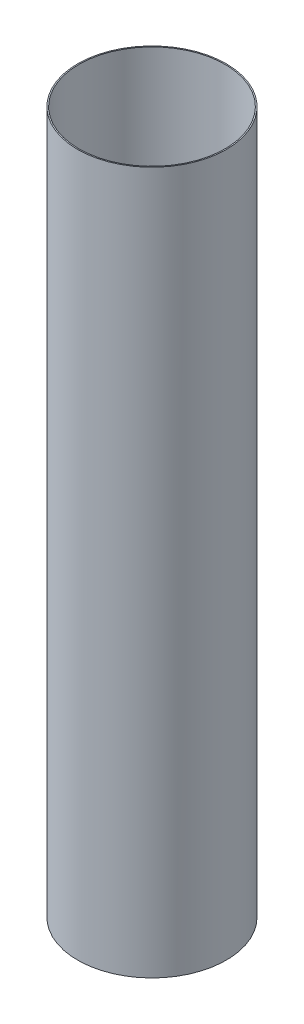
from build123d import *

# Parameters (mm, degrees)
SKETCH2_R           = 161.29
SKETCH2_R_2         = 158.75
EXTRUDE_THIN1_DEPTH = 1524
SKETCH4_W           = 5.08
SKETCH4_H           = 25.4
CUT_EXTRUDE2_DEPTH  = 8.128


with BuildPart() as part:
    # Sketch2 → Extrude-Thin1 (new body)
    with BuildSketch(Plane(origin=(0, 0, 0), x_dir=(1, 0, 0), z_dir=(0, 1, 0))):
        Circle(SKETCH2_R)
        Circle(SKETCH2_R_2, mode=Mode.SUBTRACT)
    extrude(amount=EXTRUDE_THIN1_DEPTH)

    # Sketch4 → Cut-Extrude2 (cut)
    with BuildSketch(Plane.ZY.offset(161.29)):
        with Locations((0, 12.7)):
            Rectangle(SKETCH4_W, SKETCH4_H)
    extrude(amount=-CUT_EXTRUDE2_DEPTH, mode=Mode.SUBTRACT)


solid = part.part
